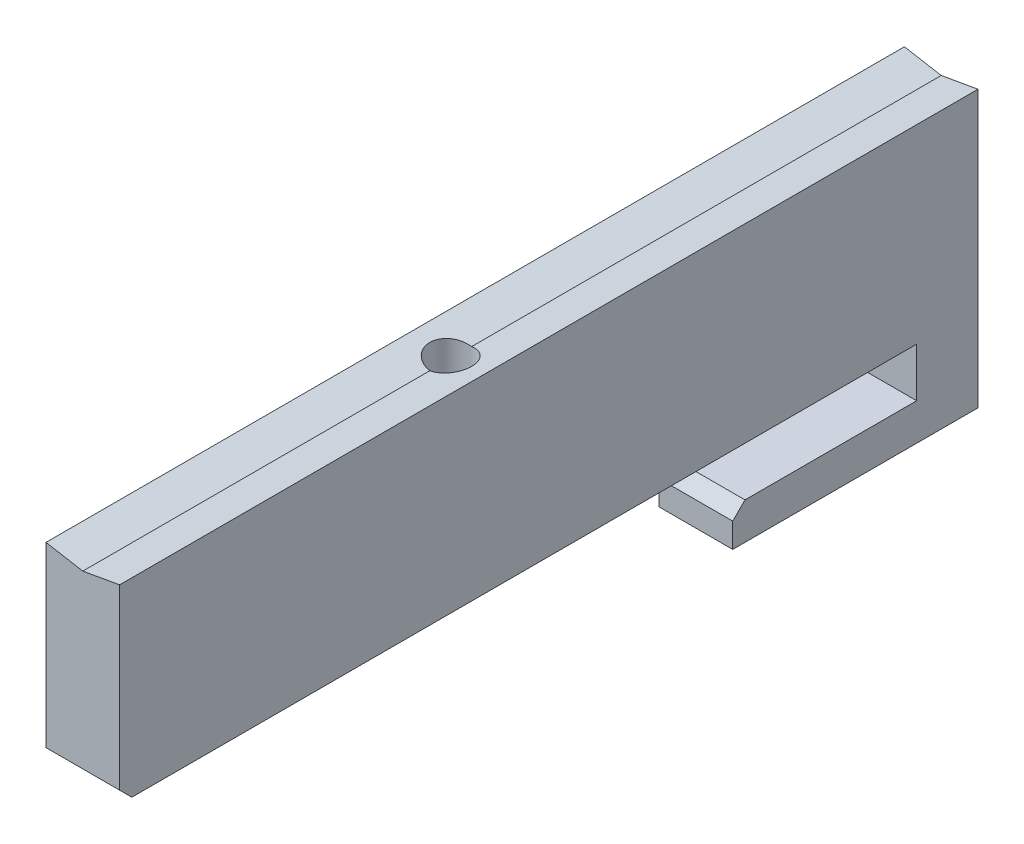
ISO-10303-21;
HEADER;
FILE_DESCRIPTION(('STEP AP214'),'2;1');
FILE_NAME('part.step','',(''),(''),'','','');
FILE_SCHEMA(('AUTOMOTIVE_DESIGN { 1 0 10303 214 1 1 1 1 }'));
ENDSEC;
DATA;
#1=APPLICATION_CONTEXT('core data for automotive mechanical design processes');
#2=APPLICATION_PROTOCOL_DEFINITION('international standard','automotive_design',2000,#1);
#3=PRODUCT_CONTEXT('',#1,'mechanical');
#4=PRODUCT('Part','Part','',(#3));
#5=PRODUCT_RELATED_PRODUCT_CATEGORY('part','',(#4));
#6=PRODUCT_DEFINITION_FORMATION('','',#4);
#7=PRODUCT_DEFINITION_CONTEXT('part definition',#1,'design');
#8=PRODUCT_DEFINITION('design','',#6,#7);
#9=PRODUCT_DEFINITION_SHAPE('','',#8);
#10=(LENGTH_UNIT() NAMED_UNIT(*) SI_UNIT(.MILLI.,.METRE.));
#11=(NAMED_UNIT(*) PLANE_ANGLE_UNIT() SI_UNIT($,.RADIAN.));
#12=(NAMED_UNIT(*) SI_UNIT($,.STERADIAN.) SOLID_ANGLE_UNIT());
#13=UNCERTAINTY_MEASURE_WITH_UNIT(LENGTH_MEASURE(1.E-05),#10,'distance_accuracy_value','');
#14=(GEOMETRIC_REPRESENTATION_CONTEXT(3) GLOBAL_UNCERTAINTY_ASSIGNED_CONTEXT((#13)) GLOBAL_UNIT_ASSIGNED_CONTEXT((#10,
#11,#12)) REPRESENTATION_CONTEXT('',''));
#15=CARTESIAN_POINT('',(0.,0.,0.));
#16=DIRECTION('',(0.,0.,1.));
#17=DIRECTION('',(1.,0.,0.));
#18=AXIS2_PLACEMENT_3D('',#15,#16,#17);
#19=CARTESIAN_POINT('',(6.,-22.5,140.));
#20=DIRECTION('',(-1.,0.,0.));
#21=DIRECTION('',(0.,0.,1.));
#22=AXIS2_PLACEMENT_3D('',#19,#20,#21);
#23=PLANE('',#22);
#24=DIRECTION('',(0.,1.,0.));
#25=VECTOR('',#24,1.);
#26=CARTESIAN_POINT('',(6.,-22.5,140.));
#27=LINE('',#26,#25);
#28=CARTESIAN_POINT('',(6.,-6.50000000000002,140.));
#29=VERTEX_POINT('',#28);
#30=CARTESIAN_POINT('',(6.,22.5,140.));
#31=VERTEX_POINT('',#30);
#32=EDGE_CURVE('E163',#29,#31,#27,.T.);
#33=ORIENTED_EDGE('',*,*,#32,.F.);
#34=DIRECTION('',(0.,0.707106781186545,0.70710678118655));
#35=VECTOR('',#34,1.);
#36=CARTESIAN_POINT('',(6.,-6.50000000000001,140.));
#37=LINE('',#36,#35);
#38=CARTESIAN_POINT('',(6.,-8.5,138.));
#39=VERTEX_POINT('',#38);
#40=EDGE_CURVE('E184',#29,#39,#37,.F.);
#41=ORIENTED_EDGE('',*,*,#40,.T.);
#42=DIRECTION('',(0.,0.,1.));
#43=VECTOR('',#42,1.);
#44=CARTESIAN_POINT('',(6.,-8.5,140.));
#45=LINE('',#44,#43);
#46=CARTESIAN_POINT('',(6.,-8.5,10.));
#47=VERTEX_POINT('',#46);
#48=EDGE_CURVE('E227',#47,#39,#45,.T.);
#49=ORIENTED_EDGE('',*,*,#48,.F.);
#50=DIRECTION('',(0.,1.,0.));
#51=VECTOR('',#50,1.);
#52=CARTESIAN_POINT('',(6.,-8.5,10.));
#53=LINE('',#52,#51);
#54=CARTESIAN_POINT('',(6.,-16.5,10.));
#55=VERTEX_POINT('',#54);
#56=EDGE_CURVE('E211',#55,#47,#53,.T.);
#57=ORIENTED_EDGE('',*,*,#56,.F.);
#58=DIRECTION('',(0.,0.,-1.));
#59=VECTOR('',#58,1.);
#60=CARTESIAN_POINT('',(6.,-16.5,10.));
#61=LINE('',#60,#59);
#62=CARTESIAN_POINT('',(6.,-16.5,38.));
#63=VERTEX_POINT('',#62);
#64=EDGE_CURVE('E203',#63,#55,#61,.T.);
#65=ORIENTED_EDGE('',*,*,#64,.F.);
#66=DIRECTION('',(0.,0.70710678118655,-0.707106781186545));
#67=VECTOR('',#66,1.);
#68=CARTESIAN_POINT('',(6.,-16.5,38.));
#69=LINE('',#68,#67);
#70=CARTESIAN_POINT('',(6.,-18.5,40.));
#71=VERTEX_POINT('',#70);
#72=EDGE_CURVE('E182',#63,#71,#69,.F.);
#73=ORIENTED_EDGE('',*,*,#72,.T.);
#74=DIRECTION('',(0.,1.,0.));
#75=VECTOR('',#74,1.);
#76=CARTESIAN_POINT('',(6.,-22.5,40.));
#77=LINE('',#76,#75);
#78=CARTESIAN_POINT('',(6.,-22.5,40.));
#79=VERTEX_POINT('',#78);
#80=EDGE_CURVE('E221',#79,#71,#77,.T.);
#81=ORIENTED_EDGE('',*,*,#80,.F.);
#82=DIRECTION('',(0.,0.,-1.));
#83=VECTOR('',#82,1.);
#84=CARTESIAN_POINT('',(6.,-22.5,140.));
#85=LINE('',#84,#83);
#86=CARTESIAN_POINT('',(6.,-22.5,0.));
#87=VERTEX_POINT('',#86);
#88=EDGE_CURVE('E162',#79,#87,#85,.T.);
#89=ORIENTED_EDGE('',*,*,#88,.T.);
#90=DIRECTION('',(0.,1.,0.));
#91=VECTOR('',#90,1.);
#92=CARTESIAN_POINT('',(6.,-22.5,0.));
#93=LINE('',#92,#91);
#94=CARTESIAN_POINT('',(6.,22.5,0.));
#95=VERTEX_POINT('',#94);
#96=EDGE_CURVE('E170',#87,#95,#93,.T.);
#97=ORIENTED_EDGE('',*,*,#96,.T.);
#98=DIRECTION('',(0.,0.,-1.));
#99=VECTOR('',#98,1.);
#100=CARTESIAN_POINT('',(6.,22.5,140.));
#101=LINE('',#100,#99);
#102=EDGE_CURVE('E145',#31,#95,#101,.T.);
#103=ORIENTED_EDGE('',*,*,#102,.F.);
#104=EDGE_LOOP('',(#33,#41,#49,#57,#65,#73,#81,#89,#97,#103));
#105=FACE_BOUND('',#104,.T.);
#106=ADVANCED_FACE('F43',(#105),#23,.F.);
#107=CARTESIAN_POINT('',(-6.,-22.5,140.));
#108=DIRECTION('',(1.,0.,0.));
#109=DIRECTION('',(0.,0.,-1.));
#110=AXIS2_PLACEMENT_3D('',#107,#108,#109);
#111=PLANE('',#110);
#112=DIRECTION('',(0.,0.,1.));
#113=VECTOR('',#112,1.);
#114=CARTESIAN_POINT('',(-6.,-8.5,140.));
#115=LINE('',#114,#113);
#116=CARTESIAN_POINT('',(-6.,-8.5,10.));
#117=VERTEX_POINT('',#116);
#118=CARTESIAN_POINT('',(-6.,-8.5,138.));
#119=VERTEX_POINT('',#118);
#120=EDGE_CURVE('E226',#117,#119,#115,.T.);
#121=ORIENTED_EDGE('',*,*,#120,.T.);
#122=DIRECTION('',(0.,-0.707106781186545,-0.70710678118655));
#123=VECTOR('',#122,1.);
#124=CARTESIAN_POINT('',(-6.,-6.50000000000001,140.));
#125=LINE('',#124,#123);
#126=CARTESIAN_POINT('',(-6.,-6.50000000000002,140.));
#127=VERTEX_POINT('',#126);
#128=EDGE_CURVE('E161',#119,#127,#125,.F.);
#129=ORIENTED_EDGE('',*,*,#128,.T.);
#130=DIRECTION('',(0.,-1.,0.));
#131=VECTOR('',#130,1.);
#132=CARTESIAN_POINT('',(-6.,-22.5,140.));
#133=LINE('',#132,#131);
#134=CARTESIAN_POINT('',(-6.,22.5,140.));
#135=VERTEX_POINT('',#134);
#136=EDGE_CURVE('E152',#135,#127,#133,.T.);
#137=ORIENTED_EDGE('',*,*,#136,.F.);
#138=DIRECTION('',(0.,0.,-1.));
#139=VECTOR('',#138,1.);
#140=CARTESIAN_POINT('',(-6.,22.5,140.));
#141=LINE('',#140,#139);
#142=CARTESIAN_POINT('',(-6.,22.5,0.));
#143=VERTEX_POINT('',#142);
#144=EDGE_CURVE('E134',#135,#143,#141,.T.);
#145=ORIENTED_EDGE('',*,*,#144,.T.);
#146=DIRECTION('',(0.,-1.,0.));
#147=VECTOR('',#146,1.);
#148=CARTESIAN_POINT('',(-6.,-22.5,0.));
#149=LINE('',#148,#147);
#150=CARTESIAN_POINT('',(-6.,-22.5,0.));
#151=VERTEX_POINT('',#150);
#152=EDGE_CURVE('E173',#143,#151,#149,.T.);
#153=ORIENTED_EDGE('',*,*,#152,.T.);
#154=DIRECTION('',(0.,0.,-1.));
#155=VECTOR('',#154,1.);
#156=CARTESIAN_POINT('',(-6.,-22.5,140.));
#157=LINE('',#156,#155);
#158=CARTESIAN_POINT('',(-6.,-22.5,40.));
#159=VERTEX_POINT('',#158);
#160=EDGE_CURVE('E146',#159,#151,#157,.T.);
#161=ORIENTED_EDGE('',*,*,#160,.F.);
#162=DIRECTION('',(0.,1.,0.));
#163=VECTOR('',#162,1.);
#164=CARTESIAN_POINT('',(-6.,-22.5,40.));
#165=LINE('',#164,#163);
#166=CARTESIAN_POINT('',(-6.,-18.5,40.));
#167=VERTEX_POINT('',#166);
#168=EDGE_CURVE('E224',#159,#167,#165,.T.);
#169=ORIENTED_EDGE('',*,*,#168,.T.);
#170=DIRECTION('',(0.,-0.70710678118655,0.707106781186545));
#171=VECTOR('',#170,1.);
#172=CARTESIAN_POINT('',(-6.,-16.5,38.));
#173=LINE('',#172,#171);
#174=CARTESIAN_POINT('',(-6.,-16.5,38.));
#175=VERTEX_POINT('',#174);
#176=EDGE_CURVE('E67',#167,#175,#173,.F.);
#177=ORIENTED_EDGE('',*,*,#176,.T.);
#178=DIRECTION('',(0.,0.,-1.));
#179=VECTOR('',#178,1.);
#180=CARTESIAN_POINT('',(-6.,-16.5,10.));
#181=LINE('',#180,#179);
#182=CARTESIAN_POINT('',(-6.,-16.5,10.));
#183=VERTEX_POINT('',#182);
#184=EDGE_CURVE('E208',#175,#183,#181,.T.);
#185=ORIENTED_EDGE('',*,*,#184,.T.);
#186=DIRECTION('',(0.,1.,0.));
#187=VECTOR('',#186,1.);
#188=CARTESIAN_POINT('',(-6.,-8.5,10.));
#189=LINE('',#188,#187);
#190=EDGE_CURVE('E210',#183,#117,#189,.T.);
#191=ORIENTED_EDGE('',*,*,#190,.T.);
#192=EDGE_LOOP('',(#121,#129,#137,#145,#153,#161,#169,#177,#185,#191));
#193=FACE_BOUND('',#192,.T.);
#194=ADVANCED_FACE('F159',(#193),#111,.F.);
#195=CARTESIAN_POINT('',(-6.,-22.5,140.));
#196=DIRECTION('',(0.,1.,0.));
#197=DIRECTION('',(0.,0.,1.));
#198=AXIS2_PLACEMENT_3D('',#195,#196,#197);
#199=PLANE('',#198);
#200=ORIENTED_EDGE('',*,*,#88,.F.);
#201=DIRECTION('',(1.,0.,0.));
#202=VECTOR('',#201,1.);
#203=CARTESIAN_POINT('',(-6.,-22.5,40.));
#204=LINE('',#203,#202);
#205=EDGE_CURVE('E174',#159,#79,#204,.T.);
#206=ORIENTED_EDGE('',*,*,#205,.F.);
#207=ORIENTED_EDGE('',*,*,#160,.T.);
#208=DIRECTION('',(1.,0.,0.));
#209=VECTOR('',#208,1.);
#210=CARTESIAN_POINT('',(-6.,-22.5,0.));
#211=LINE('',#210,#209);
#212=EDGE_CURVE('E166',#151,#87,#211,.T.);
#213=ORIENTED_EDGE('',*,*,#212,.T.);
#214=EDGE_LOOP('',(#200,#206,#207,#213));
#215=FACE_BOUND('',#214,.T.);
#216=ADVANCED_FACE('F243',(#215),#199,.F.);
#217=CARTESIAN_POINT('',(0.,0.,140.));
#218=DIRECTION('',(0.,0.,-1.));
#219=DIRECTION('',(-1.,0.,0.));
#220=AXIS2_PLACEMENT_3D('',#217,#218,#219);
#221=PLANE('',#220);
#222=DIRECTION('',(-0.984807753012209,-0.173648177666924,0.));
#223=VECTOR('',#222,1.);
#224=CARTESIAN_POINT('',(0.,21.4420381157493,140.));
#225=LINE('',#224,#223);
#226=CARTESIAN_POINT('',(0.,21.4420381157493,140.));
#227=VERTEX_POINT('',#226);
#228=EDGE_CURVE('E155',#31,#227,#225,.T.);
#229=ORIENTED_EDGE('',*,*,#228,.T.);
#230=DIRECTION('',(-0.984807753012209,0.173648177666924,0.));
#231=VECTOR('',#230,1.);
#232=CARTESIAN_POINT('',(-6.,22.5,140.));
#233=LINE('',#232,#231);
#234=EDGE_CURVE('E138',#227,#135,#233,.T.);
#235=ORIENTED_EDGE('',*,*,#234,.T.);
#236=ORIENTED_EDGE('',*,*,#136,.T.);
#237=DIRECTION('',(1.,0.,0.));
#238=VECTOR('',#237,1.);
#239=CARTESIAN_POINT('',(0.,-6.50000000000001,140.));
#240=LINE('',#239,#238);
#241=EDGE_CURVE('E180',#127,#29,#240,.T.);
#242=ORIENTED_EDGE('',*,*,#241,.T.);
#243=ORIENTED_EDGE('',*,*,#32,.T.);
#244=EDGE_LOOP('',(#229,#235,#236,#242,#243));
#245=FACE_BOUND('',#244,.T.);
#246=ADVANCED_FACE('F150',(#245),#221,.F.);
#247=CARTESIAN_POINT('',(0.,0.,0.));
#248=DIRECTION('',(0.,0.,-1.));
#249=DIRECTION('',(-1.,0.,0.));
#250=AXIS2_PLACEMENT_3D('',#247,#248,#249);
#251=PLANE('',#250);
#252=DIRECTION('',(-0.984807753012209,0.173648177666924,0.));
#253=VECTOR('',#252,1.);
#254=CARTESIAN_POINT('',(-6.,22.5,0.));
#255=LINE('',#254,#253);
#256=CARTESIAN_POINT('',(0.,21.4420381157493,0.));
#257=VERTEX_POINT('',#256);
#258=EDGE_CURVE('E141',#257,#143,#255,.T.);
#259=ORIENTED_EDGE('',*,*,#258,.F.);
#260=DIRECTION('',(-0.984807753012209,-0.173648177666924,0.));
#261=VECTOR('',#260,1.);
#262=CARTESIAN_POINT('',(0.,21.4420381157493,0.));
#263=LINE('',#262,#261);
#264=EDGE_CURVE('E156',#95,#257,#263,.T.);
#265=ORIENTED_EDGE('',*,*,#264,.F.);
#266=ORIENTED_EDGE('',*,*,#96,.F.);
#267=ORIENTED_EDGE('',*,*,#212,.F.);
#268=ORIENTED_EDGE('',*,*,#152,.F.);
#269=EDGE_LOOP('',(#259,#265,#266,#267,#268));
#270=FACE_BOUND('',#269,.T.);
#271=ADVANCED_FACE('F248',(#270),#251,.T.);
#272=CARTESIAN_POINT('',(-6.,-8.5,140.));
#273=DIRECTION('',(0.,1.,0.));
#274=DIRECTION('',(0.,0.,1.));
#275=AXIS2_PLACEMENT_3D('',#272,#273,#274);
#276=PLANE('',#275);
#277=CARTESIAN_POINT('',(0.,-8.5,80.));
#278=DIRECTION('',(0.,1.,0.));
#279=DIRECTION('',(0.,0.,1.));
#280=AXIS2_PLACEMENT_3D('',#277,#278,#279);
#281=CIRCLE('',#280,3.39999999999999);
#282=CARTESIAN_POINT('',(0.,-8.5,83.4));
#283=VERTEX_POINT('',#282);
#284=EDGE_CURVE('E200',#283,#283,#281,.T.);
#285=ORIENTED_EDGE('',*,*,#284,.T.);
#286=EDGE_LOOP('',(#285));
#287=FACE_BOUND('',#286,.T.);
#288=ORIENTED_EDGE('',*,*,#48,.T.);
#289=DIRECTION('',(-1.,0.,0.));
#290=VECTOR('',#289,1.);
#291=CARTESIAN_POINT('',(-6.,-8.5,138.));
#292=LINE('',#291,#290);
#293=EDGE_CURVE('E186',#39,#119,#292,.T.);
#294=ORIENTED_EDGE('',*,*,#293,.T.);
#295=ORIENTED_EDGE('',*,*,#120,.F.);
#296=DIRECTION('',(1.,0.,0.));
#297=VECTOR('',#296,1.);
#298=CARTESIAN_POINT('',(-6.,-8.5,10.));
#299=LINE('',#298,#297);
#300=EDGE_CURVE('E218',#117,#47,#299,.T.);
#301=ORIENTED_EDGE('',*,*,#300,.T.);
#302=EDGE_LOOP('',(#288,#294,#295,#301));
#303=FACE_BOUND('',#302,.T.);
#304=ADVANCED_FACE('F256',(#287,#303),#276,.F.);
#305=CARTESIAN_POINT('',(-6.,-22.5,40.));
#306=DIRECTION('',(0.,0.,-1.));
#307=DIRECTION('',(-1.,0.,0.));
#308=AXIS2_PLACEMENT_3D('',#305,#306,#307);
#309=PLANE('',#308);
#310=ORIENTED_EDGE('',*,*,#80,.T.);
#311=DIRECTION('',(-1.,0.,0.));
#312=VECTOR('',#311,1.);
#313=CARTESIAN_POINT('',(-6.,-18.5,40.));
#314=LINE('',#313,#312);
#315=EDGE_CURVE('E193',#71,#167,#314,.T.);
#316=ORIENTED_EDGE('',*,*,#315,.T.);
#317=ORIENTED_EDGE('',*,*,#168,.F.);
#318=ORIENTED_EDGE('',*,*,#205,.T.);
#319=EDGE_LOOP('',(#310,#316,#317,#318));
#320=FACE_BOUND('',#319,.T.);
#321=ADVANCED_FACE('F235',(#320),#309,.F.);
#322=CARTESIAN_POINT('',(-6.,-8.5,10.));
#323=DIRECTION('',(0.,0.,-1.));
#324=DIRECTION('',(-1.,0.,0.));
#325=AXIS2_PLACEMENT_3D('',#322,#323,#324);
#326=PLANE('',#325);
#327=ORIENTED_EDGE('',*,*,#56,.T.);
#328=ORIENTED_EDGE('',*,*,#300,.F.);
#329=ORIENTED_EDGE('',*,*,#190,.F.);
#330=DIRECTION('',(1.,0.,0.));
#331=VECTOR('',#330,1.);
#332=CARTESIAN_POINT('',(-6.,-16.5,10.));
#333=LINE('',#332,#331);
#334=EDGE_CURVE('E214',#183,#55,#333,.T.);
#335=ORIENTED_EDGE('',*,*,#334,.T.);
#336=EDGE_LOOP('',(#327,#328,#329,#335));
#337=FACE_BOUND('',#336,.T.);
#338=ADVANCED_FACE('F260',(#337),#326,.F.);
#339=CARTESIAN_POINT('',(-6.,-16.5,10.));
#340=DIRECTION('',(0.,-1.,0.));
#341=DIRECTION('',(0.,0.,-1.));
#342=AXIS2_PLACEMENT_3D('',#339,#340,#341);
#343=PLANE('',#342);
#344=ORIENTED_EDGE('',*,*,#184,.F.);
#345=DIRECTION('',(1.,0.,0.));
#346=VECTOR('',#345,1.);
#347=CARTESIAN_POINT('',(-6.,-16.5,38.));
#348=LINE('',#347,#346);
#349=EDGE_CURVE('E190',#175,#63,#348,.T.);
#350=ORIENTED_EDGE('',*,*,#349,.T.);
#351=ORIENTED_EDGE('',*,*,#64,.T.);
#352=ORIENTED_EDGE('',*,*,#334,.F.);
#353=EDGE_LOOP('',(#344,#350,#351,#352));
#354=FACE_BOUND('',#353,.T.);
#355=ADVANCED_FACE('F263',(#354),#343,.F.);
#356=CARTESIAN_POINT('',(0.,-6.50000000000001,140.));
#357=DIRECTION('',(0.,0.70710678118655,-0.707106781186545));
#358=DIRECTION('',(1.,0.,0.));
#359=AXIS2_PLACEMENT_3D('',#356,#357,#358);
#360=PLANE('',#359);
#361=ORIENTED_EDGE('',*,*,#128,.F.);
#362=ORIENTED_EDGE('',*,*,#293,.F.);
#363=ORIENTED_EDGE('',*,*,#40,.F.);
#364=ORIENTED_EDGE('',*,*,#241,.F.);
#365=EDGE_LOOP('',(#361,#362,#363,#364));
#366=FACE_BOUND('',#365,.T.);
#367=ADVANCED_FACE('F252',(#366),#360,.F.);
#368=CARTESIAN_POINT('',(-6.,-16.5,38.));
#369=DIRECTION('',(0.,-0.707106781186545,-0.70710678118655));
#370=DIRECTION('',(1.,0.,0.));
#371=AXIS2_PLACEMENT_3D('',#368,#369,#370);
#372=PLANE('',#371);
#373=ORIENTED_EDGE('',*,*,#176,.F.);
#374=ORIENTED_EDGE('',*,*,#315,.F.);
#375=ORIENTED_EDGE('',*,*,#72,.F.);
#376=ORIENTED_EDGE('',*,*,#349,.F.);
#377=EDGE_LOOP('',(#373,#374,#375,#376));
#378=FACE_BOUND('',#377,.T.);
#379=ADVANCED_FACE('F46',(#378),#372,.F.);
#380=CARTESIAN_POINT('',(0.,22.5,80.));
#381=DIRECTION('',(0.,1.,0.));
#382=DIRECTION('',(0.,0.,1.));
#383=AXIS2_PLACEMENT_3D('',#380,#381,#382);
#384=CYLINDRICAL_SURFACE('',#383,3.39999999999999);
#385=CARTESIAN_POINT('',(0.,21.4420381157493,80.));
#386=DIRECTION('',(0.173648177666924,-0.984807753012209,0.));
#387=DIRECTION('',(0.984807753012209,0.173648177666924,0.));
#388=AXIS2_PLACEMENT_3D('',#385,#386,#387);
#389=ELLIPSE('',#388,3.45245048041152,3.39999999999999);
#390=CARTESIAN_POINT('',(0.,21.4420381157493,83.4));
#391=VERTEX_POINT('',#390);
#392=CARTESIAN_POINT('',(0.,21.4420381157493,76.6));
#393=VERTEX_POINT('',#392);
#394=EDGE_CURVE('E52',#391,#393,#389,.F.);
#395=ORIENTED_EDGE('',*,*,#394,.T.);
#396=CARTESIAN_POINT('',(0.,21.4420381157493,80.));
#397=DIRECTION('',(-0.173648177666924,-0.984807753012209,0.));
#398=DIRECTION('',(-0.984807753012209,0.173648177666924,0.));
#399=AXIS2_PLACEMENT_3D('',#396,#397,#398);
#400=ELLIPSE('',#399,3.45245048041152,3.39999999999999);
#401=EDGE_CURVE('E11',#393,#391,#400,.F.);
#402=ORIENTED_EDGE('',*,*,#401,.T.);
#403=EDGE_LOOP('',(#395,#402));
#404=FACE_BOUND('',#403,.T.);
#405=ORIENTED_EDGE('',*,*,#284,.F.);
#406=EDGE_LOOP('',(#405));
#407=FACE_BOUND('',#406,.T.);
#408=ADVANCED_FACE('F196',(#404,#407),#384,.F.);
#409=CARTESIAN_POINT('',(-6.,22.5,140.));
#410=DIRECTION('',(-0.173648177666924,-0.984807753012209,0.));
#411=DIRECTION('',(0.984807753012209,-0.173648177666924,0.));
#412=AXIS2_PLACEMENT_3D('',#409,#410,#411);
#413=PLANE('',#412);
#414=DIRECTION('',(0.,0.,-1.));
#415=VECTOR('',#414,1.);
#416=CARTESIAN_POINT('',(0.,21.4420381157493,140.));
#417=LINE('',#416,#415);
#418=EDGE_CURVE('E59',#393,#257,#417,.T.);
#419=ORIENTED_EDGE('',*,*,#418,.T.);
#420=ORIENTED_EDGE('',*,*,#258,.T.);
#421=ORIENTED_EDGE('',*,*,#144,.F.);
#422=ORIENTED_EDGE('',*,*,#234,.F.);
#423=EDGE_CURVE('E199',#227,#391,#417,.T.);
#424=ORIENTED_EDGE('',*,*,#423,.T.);
#425=ORIENTED_EDGE('',*,*,#401,.F.);
#426=EDGE_LOOP('',(#419,#420,#421,#422,#424,#425));
#427=FACE_BOUND('',#426,.T.);
#428=ADVANCED_FACE('F136',(#427),#413,.F.);
#429=CARTESIAN_POINT('',(0.,21.4420381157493,140.));
#430=DIRECTION('',(0.173648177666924,-0.984807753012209,0.));
#431=DIRECTION('',(0.984807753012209,0.173648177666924,0.));
#432=AXIS2_PLACEMENT_3D('',#429,#430,#431);
#433=PLANE('',#432);
#434=ORIENTED_EDGE('',*,*,#423,.F.);
#435=ORIENTED_EDGE('',*,*,#228,.F.);
#436=ORIENTED_EDGE('',*,*,#102,.T.);
#437=ORIENTED_EDGE('',*,*,#264,.T.);
#438=ORIENTED_EDGE('',*,*,#418,.F.);
#439=ORIENTED_EDGE('',*,*,#394,.F.);
#440=EDGE_LOOP('',(#434,#435,#436,#437,#438,#439));
#441=FACE_BOUND('',#440,.T.);
#442=ADVANCED_FACE('F198',(#441),#433,.F.);
#443=CLOSED_SHELL('',(#106,#194,#216,#246,#271,#304,#321,#338,#355,#367,#379,#408,#428,#442));
#444=MANIFOLD_SOLID_BREP('B2',#443);
#445=ADVANCED_BREP_SHAPE_REPRESENTATION('',(#18,#444),#14);
#446=SHAPE_DEFINITION_REPRESENTATION(#9,#445);
ENDSEC;
END-ISO-10303-21;
